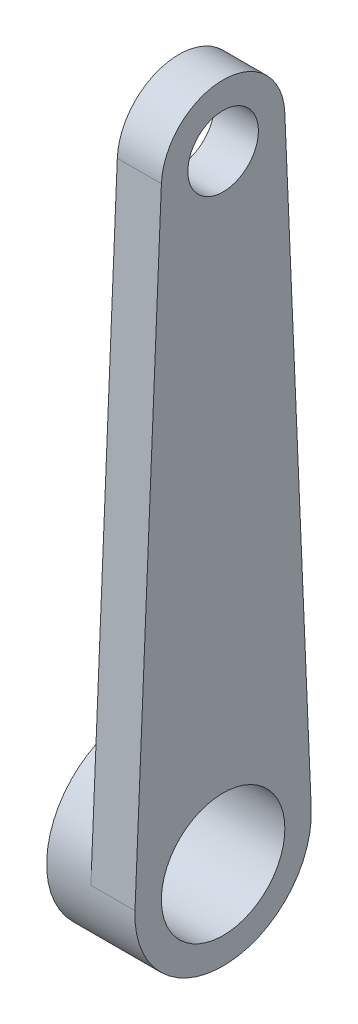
ISO-10303-21;
HEADER;
FILE_DESCRIPTION(('STEP AP214'),'2;1');
FILE_NAME('part.step','',(''),(''),'','','');
FILE_SCHEMA(('AUTOMOTIVE_DESIGN { 1 0 10303 214 1 1 1 1 }'));
ENDSEC;
DATA;
#1=APPLICATION_CONTEXT('core data for automotive mechanical design processes');
#2=APPLICATION_PROTOCOL_DEFINITION('international standard','automotive_design',2000,#1);
#3=PRODUCT_CONTEXT('',#1,'mechanical');
#4=PRODUCT('Part','Part','',(#3));
#5=PRODUCT_RELATED_PRODUCT_CATEGORY('part','',(#4));
#6=PRODUCT_DEFINITION_FORMATION('','',#4);
#7=PRODUCT_DEFINITION_CONTEXT('part definition',#1,'design');
#8=PRODUCT_DEFINITION('design','',#6,#7);
#9=PRODUCT_DEFINITION_SHAPE('','',#8);
#10=(LENGTH_UNIT() NAMED_UNIT(*) SI_UNIT(.MILLI.,.METRE.));
#11=(NAMED_UNIT(*) PLANE_ANGLE_UNIT() SI_UNIT($,.RADIAN.));
#12=(NAMED_UNIT(*) SI_UNIT($,.STERADIAN.) SOLID_ANGLE_UNIT());
#13=UNCERTAINTY_MEASURE_WITH_UNIT(LENGTH_MEASURE(1.E-05),#10,'distance_accuracy_value','');
#14=(GEOMETRIC_REPRESENTATION_CONTEXT(3) GLOBAL_UNCERTAINTY_ASSIGNED_CONTEXT((#13)) GLOBAL_UNIT_ASSIGNED_CONTEXT((#10,
#11,#12)) REPRESENTATION_CONTEXT('',''));
#15=CARTESIAN_POINT('',(0.,0.,0.));
#16=DIRECTION('',(0.,0.,1.));
#17=DIRECTION('',(1.,0.,0.));
#18=AXIS2_PLACEMENT_3D('',#15,#16,#17);
#19=CARTESIAN_POINT('',(0.,0.,0.));
#20=DIRECTION('',(1.,0.,0.));
#21=DIRECTION('',(0.,0.,-1.));
#22=AXIS2_PLACEMENT_3D('',#19,#20,#21);
#23=PLANE('',#22);
#24=CARTESIAN_POINT('',(0.,0.,0.));
#25=DIRECTION('',(1.,0.,0.));
#26=DIRECTION('',(0.,0.,-1.));
#27=AXIS2_PLACEMENT_3D('',#24,#25,#26);
#28=CIRCLE('',#27,10.);
#29=CARTESIAN_POINT('',(0.,0.,-10.));
#30=VERTEX_POINT('',#29);
#31=EDGE_CURVE('E92',#30,#30,#28,.T.);
#32=ORIENTED_EDGE('',*,*,#31,.T.);
#33=EDGE_LOOP('',(#32));
#34=FACE_BOUND('',#33,.T.);
#35=CARTESIAN_POINT('',(0.,-175.,0.));
#36=DIRECTION('',(1.,0.,0.));
#37=DIRECTION('',(0.,0.,-1.));
#38=AXIS2_PLACEMENT_3D('',#35,#36,#37);
#39=CIRCLE('',#38,25.);
#40=CARTESIAN_POINT('',(0.,-173.928571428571,24.9770302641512));
#41=VERTEX_POINT('',#40);
#42=CARTESIAN_POINT('',(0.,-173.928571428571,-24.9770302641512));
#43=VERTEX_POINT('',#42);
#44=EDGE_CURVE('E98',#41,#43,#39,.F.);
#45=ORIENTED_EDGE('',*,*,#44,.F.);
#46=DIRECTION('',(0.,-0.999081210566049,0.0428571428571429));
#47=VECTOR('',#46,1.);
#48=CARTESIAN_POINT('',(0.,0.750000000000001,17.4839211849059));
#49=LINE('',#48,#47);
#50=CARTESIAN_POINT('',(0.,0.750000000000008,17.4839211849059));
#51=VERTEX_POINT('',#50);
#52=EDGE_CURVE('E85',#51,#41,#49,.T.);
#53=ORIENTED_EDGE('',*,*,#52,.F.);
#54=CARTESIAN_POINT('',(0.,0.,0.));
#55=DIRECTION('',(1.,0.,0.));
#56=DIRECTION('',(0.,0.,-1.));
#57=AXIS2_PLACEMENT_3D('',#54,#55,#56);
#58=CIRCLE('',#57,17.5);
#59=CARTESIAN_POINT('',(0.,0.750000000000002,-17.4839211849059));
#60=VERTEX_POINT('',#59);
#61=EDGE_CURVE('E73',#60,#51,#58,.T.);
#62=ORIENTED_EDGE('',*,*,#61,.F.);
#63=DIRECTION('',(0.,-0.999081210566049,-0.0428571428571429));
#64=VECTOR('',#63,1.);
#65=CARTESIAN_POINT('',(0.,0.750000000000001,-17.4839211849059));
#66=LINE('',#65,#64);
#67=EDGE_CURVE('E91',#60,#43,#66,.T.);
#68=ORIENTED_EDGE('',*,*,#67,.T.);
#69=EDGE_LOOP('',(#45,#53,#62,#68));
#70=FACE_BOUND('',#69,.T.);
#71=ADVANCED_FACE('F39',(#34,#70),#23,.F.);
#72=CARTESIAN_POINT('',(12.5,0.750000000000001,17.4839211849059));
#73=DIRECTION('',(0.,-0.0428571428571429,-0.999081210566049));
#74=DIRECTION('',(0.,0.999081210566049,-0.0428571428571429));
#75=AXIS2_PLACEMENT_3D('',#72,#73,#74);
#76=PLANE('',#75);
#77=ORIENTED_EDGE('',*,*,#52,.T.);
#78=DIRECTION('',(-1.,0.,0.));
#79=VECTOR('',#78,1.);
#80=CARTESIAN_POINT('',(12.5,-173.928571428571,24.9770302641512));
#81=LINE('',#80,#79);
#82=CARTESIAN_POINT('',(12.5,-173.928571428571,24.9770302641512));
#83=VERTEX_POINT('',#82);
#84=EDGE_CURVE('E11',#83,#41,#81,.T.);
#85=ORIENTED_EDGE('',*,*,#84,.F.);
#86=DIRECTION('',(0.,-0.999081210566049,0.0428571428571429));
#87=VECTOR('',#86,1.);
#88=CARTESIAN_POINT('',(12.5,0.750000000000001,17.4839211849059));
#89=LINE('',#88,#87);
#90=CARTESIAN_POINT('',(12.5,0.750000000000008,17.4839211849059));
#91=VERTEX_POINT('',#90);
#92=EDGE_CURVE('E78',#91,#83,#89,.T.);
#93=ORIENTED_EDGE('',*,*,#92,.F.);
#94=DIRECTION('',(-1.,0.,0.));
#95=VECTOR('',#94,1.);
#96=CARTESIAN_POINT('',(12.5,0.750000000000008,17.4839211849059));
#97=LINE('',#96,#95);
#98=EDGE_CURVE('E88',#91,#51,#97,.T.);
#99=ORIENTED_EDGE('',*,*,#98,.T.);
#100=EDGE_LOOP('',(#77,#85,#93,#99));
#101=FACE_BOUND('',#100,.T.);
#102=ADVANCED_FACE('F86',(#101),#76,.F.);
#103=CARTESIAN_POINT('',(12.5,-175.,0.));
#104=DIRECTION('',(-1.,0.,0.));
#105=DIRECTION('',(0.,0.,1.));
#106=AXIS2_PLACEMENT_3D('',#103,#104,#105);
#107=CYLINDRICAL_SURFACE('',#106,25.);
#108=ORIENTED_EDGE('',*,*,#84,.T.);
#109=ORIENTED_EDGE('',*,*,#44,.T.);
#110=DIRECTION('',(-1.,0.,0.));
#111=VECTOR('',#110,1.);
#112=CARTESIAN_POINT('',(12.5,-173.928571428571,-24.9770302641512));
#113=LINE('',#112,#111);
#114=CARTESIAN_POINT('',(12.5,-173.928571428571,-24.9770302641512));
#115=VERTEX_POINT('',#114);
#116=EDGE_CURVE('E48',#115,#43,#113,.T.);
#117=ORIENTED_EDGE('',*,*,#116,.F.);
#118=CARTESIAN_POINT('',(12.5,-175.,0.));
#119=DIRECTION('',(1.,0.,0.));
#120=DIRECTION('',(0.,0.,-1.));
#121=AXIS2_PLACEMENT_3D('',#118,#119,#120);
#122=CIRCLE('',#121,25.);
#123=EDGE_CURVE('E99',#115,#83,#122,.F.);
#124=ORIENTED_EDGE('',*,*,#123,.T.);
#125=EDGE_LOOP('',(#108,#109,#117,#124));
#126=FACE_BOUND('',#125,.T.);
#127=CARTESIAN_POINT('',(-12.5,-175.,0.));
#128=DIRECTION('',(1.,0.,0.));
#129=DIRECTION('',(0.,0.,-1.));
#130=AXIS2_PLACEMENT_3D('',#127,#128,#129);
#131=CIRCLE('',#130,25.);
#132=CARTESIAN_POINT('',(-12.5,-175.,-25.));
#133=VERTEX_POINT('',#132);
#134=EDGE_CURVE('E102',#133,#133,#131,.F.);
#135=ORIENTED_EDGE('',*,*,#134,.F.);
#136=EDGE_LOOP('',(#135));
#137=FACE_BOUND('',#136,.T.);
#138=ADVANCED_FACE('F96',(#126,#137),#107,.T.);
#139=CARTESIAN_POINT('',(12.5,0.750000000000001,-17.4839211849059));
#140=DIRECTION('',(0.,0.0428571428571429,-0.999081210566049));
#141=DIRECTION('',(0.,0.999081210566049,0.0428571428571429));
#142=AXIS2_PLACEMENT_3D('',#139,#140,#141);
#143=PLANE('',#142);
#144=ORIENTED_EDGE('',*,*,#67,.F.);
#145=DIRECTION('',(-1.,0.,0.));
#146=VECTOR('',#145,1.);
#147=CARTESIAN_POINT('',(12.5,0.750000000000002,-17.4839211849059));
#148=LINE('',#147,#146);
#149=CARTESIAN_POINT('',(12.5,0.750000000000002,-17.4839211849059));
#150=VERTEX_POINT('',#149);
#151=EDGE_CURVE('E70',#150,#60,#148,.T.);
#152=ORIENTED_EDGE('',*,*,#151,.F.);
#153=DIRECTION('',(0.,-0.999081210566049,-0.0428571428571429));
#154=VECTOR('',#153,1.);
#155=CARTESIAN_POINT('',(12.5,0.750000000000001,-17.4839211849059));
#156=LINE('',#155,#154);
#157=EDGE_CURVE('E114',#150,#115,#156,.T.);
#158=ORIENTED_EDGE('',*,*,#157,.T.);
#159=ORIENTED_EDGE('',*,*,#116,.T.);
#160=EDGE_LOOP('',(#144,#152,#158,#159));
#161=FACE_BOUND('',#160,.T.);
#162=ADVANCED_FACE('F127',(#161),#143,.T.);
#163=CARTESIAN_POINT('',(12.5,0.,0.));
#164=DIRECTION('',(-1.,0.,0.));
#165=DIRECTION('',(0.,0.,1.));
#166=AXIS2_PLACEMENT_3D('',#163,#164,#165);
#167=CYLINDRICAL_SURFACE('',#166,17.5);
#168=ORIENTED_EDGE('',*,*,#61,.T.);
#169=ORIENTED_EDGE('',*,*,#98,.F.);
#170=CARTESIAN_POINT('',(12.5,0.,0.));
#171=DIRECTION('',(1.,0.,0.));
#172=DIRECTION('',(0.,0.,-1.));
#173=AXIS2_PLACEMENT_3D('',#170,#171,#172);
#174=CIRCLE('',#173,17.5);
#175=EDGE_CURVE('E56',#150,#91,#174,.T.);
#176=ORIENTED_EDGE('',*,*,#175,.F.);
#177=ORIENTED_EDGE('',*,*,#151,.T.);
#178=EDGE_LOOP('',(#168,#169,#176,#177));
#179=FACE_BOUND('',#178,.T.);
#180=ADVANCED_FACE('F155',(#179),#167,.T.);
#181=CARTESIAN_POINT('',(12.5,0.,0.));
#182=DIRECTION('',(-1.,0.,0.));
#183=DIRECTION('',(0.,0.,1.));
#184=AXIS2_PLACEMENT_3D('',#181,#182,#183);
#185=CYLINDRICAL_SURFACE('',#184,10.);
#186=CARTESIAN_POINT('',(12.5,0.,0.));
#187=DIRECTION('',(1.,0.,0.));
#188=DIRECTION('',(0.,0.,-1.));
#189=AXIS2_PLACEMENT_3D('',#186,#187,#188);
#190=CIRCLE('',#189,10.);
#191=CARTESIAN_POINT('',(12.5,0.,-10.));
#192=VERTEX_POINT('',#191);
#193=EDGE_CURVE('E109',#192,#192,#190,.T.);
#194=ORIENTED_EDGE('',*,*,#193,.T.);
#195=EDGE_LOOP('',(#194));
#196=FACE_BOUND('',#195,.T.);
#197=ORIENTED_EDGE('',*,*,#31,.F.);
#198=EDGE_LOOP('',(#197));
#199=FACE_BOUND('',#198,.T.);
#200=ADVANCED_FACE('F41',(#196,#199),#185,.F.);
#201=CARTESIAN_POINT('',(12.5,-175.,0.));
#202=DIRECTION('',(-1.,0.,0.));
#203=DIRECTION('',(0.,0.,1.));
#204=AXIS2_PLACEMENT_3D('',#201,#202,#203);
#205=CYLINDRICAL_SURFACE('',#204,17.5);
#206=CARTESIAN_POINT('',(12.5,-175.,0.));
#207=DIRECTION('',(1.,0.,0.));
#208=DIRECTION('',(0.,0.,-1.));
#209=AXIS2_PLACEMENT_3D('',#206,#207,#208);
#210=CIRCLE('',#209,17.5);
#211=CARTESIAN_POINT('',(12.5,-175.,-17.5));
#212=VERTEX_POINT('',#211);
#213=EDGE_CURVE('E118',#212,#212,#210,.T.);
#214=ORIENTED_EDGE('',*,*,#213,.T.);
#215=EDGE_LOOP('',(#214));
#216=FACE_BOUND('',#215,.T.);
#217=CARTESIAN_POINT('',(-12.5,-175.,0.));
#218=DIRECTION('',(1.,0.,0.));
#219=DIRECTION('',(0.,0.,-1.));
#220=AXIS2_PLACEMENT_3D('',#217,#218,#219);
#221=CIRCLE('',#220,17.5);
#222=CARTESIAN_POINT('',(-12.5,-175.,-17.5));
#223=VERTEX_POINT('',#222);
#224=EDGE_CURVE('E105',#223,#223,#221,.T.);
#225=ORIENTED_EDGE('',*,*,#224,.F.);
#226=EDGE_LOOP('',(#225));
#227=FACE_BOUND('',#226,.T.);
#228=ADVANCED_FACE('F132',(#216,#227),#205,.F.);
#229=CARTESIAN_POINT('',(12.5,0.,0.));
#230=DIRECTION('',(1.,0.,0.));
#231=DIRECTION('',(0.,0.,-1.));
#232=AXIS2_PLACEMENT_3D('',#229,#230,#231);
#233=PLANE('',#232);
#234=ORIENTED_EDGE('',*,*,#193,.F.);
#235=EDGE_LOOP('',(#234));
#236=FACE_BOUND('',#235,.T.);
#237=ORIENTED_EDGE('',*,*,#92,.T.);
#238=ORIENTED_EDGE('',*,*,#123,.F.);
#239=ORIENTED_EDGE('',*,*,#157,.F.);
#240=ORIENTED_EDGE('',*,*,#175,.T.);
#241=EDGE_LOOP('',(#237,#238,#239,#240));
#242=FACE_BOUND('',#241,.T.);
#243=ORIENTED_EDGE('',*,*,#213,.F.);
#244=EDGE_LOOP('',(#243));
#245=FACE_BOUND('',#244,.T.);
#246=ADVANCED_FACE('F128',(#236,#242,#245),#233,.T.);
#247=CARTESIAN_POINT('',(-12.5,0.,0.));
#248=DIRECTION('',(1.,0.,0.));
#249=DIRECTION('',(0.,0.,-1.));
#250=AXIS2_PLACEMENT_3D('',#247,#248,#249);
#251=PLANE('',#250);
#252=ORIENTED_EDGE('',*,*,#134,.T.);
#253=EDGE_LOOP('',(#252));
#254=FACE_BOUND('',#253,.T.);
#255=ORIENTED_EDGE('',*,*,#224,.T.);
#256=EDGE_LOOP('',(#255));
#257=FACE_BOUND('',#256,.T.);
#258=ADVANCED_FACE('F131',(#254,#257),#251,.F.);
#259=CLOSED_SHELL('',(#71,#102,#138,#162,#180,#200,#228,#246,#258));
#260=MANIFOLD_SOLID_BREP('B2',#259);
#261=ADVANCED_BREP_SHAPE_REPRESENTATION('',(#18,#260),#14);
#262=SHAPE_DEFINITION_REPRESENTATION(#9,#261);
ENDSEC;
END-ISO-10303-21;
